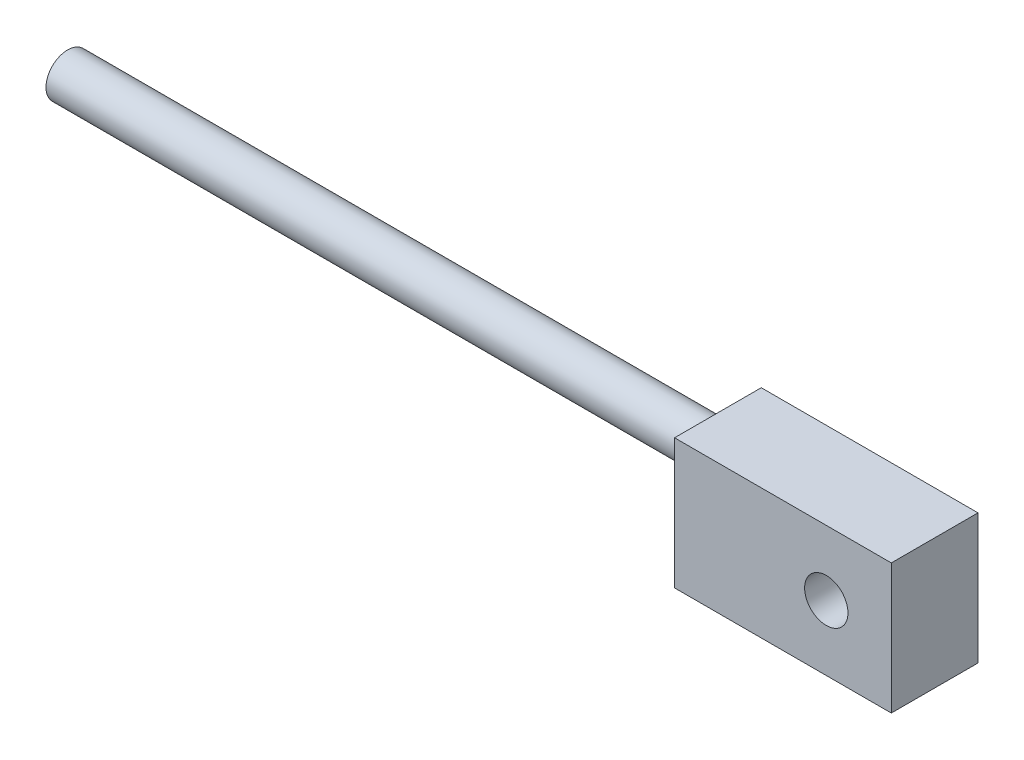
from build123d import *

# Parameters (mm, degrees)
EXTRUDE_1_DEPTH      = 20
EXTRUDE_1_DEPTH_BACK = 20
SKETCH_1_W           = 100
SKETCH_1_H           = 60
SKETCH_1_R           = 10
SKETCH_2_R           = 10
EXTRUDE_2_DEPTH      = 300


with BuildPart() as part:
    # Sketch 1 → Extrude 1 (new, two sides: drawn at the far end of the back side and taken through both)
    with BuildSketch(Plane.XY.offset(-EXTRUDE_1_DEPTH_BACK)):
        with Locations((-20, 0)):
            Rectangle(SKETCH_1_W, SKETCH_1_H)
        Circle(SKETCH_1_R, mode=Mode.SUBTRACT)
    extrude(amount=EXTRUDE_1_DEPTH + EXTRUDE_1_DEPTH_BACK)

    # Sketch 2 → Extrude 2 (add)
    with BuildSketch(Plane.ZY.offset(70)):
        with Locations((0, 15)):
            Circle(SKETCH_2_R)
    extrude(amount=EXTRUDE_2_DEPTH)


solid = part.part
